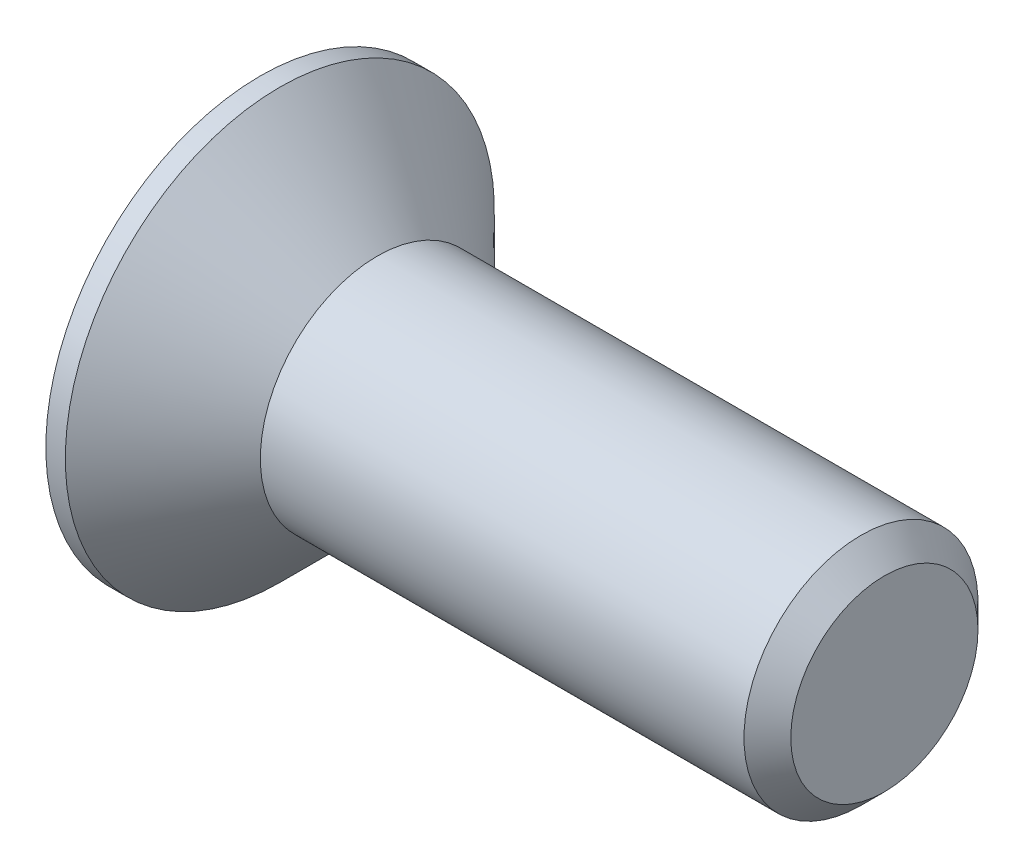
ISO-10303-21;
HEADER;
FILE_DESCRIPTION(('STEP AP214'),'2;1');
FILE_NAME('part.step','',(''),(''),'','','');
FILE_SCHEMA(('AUTOMOTIVE_DESIGN { 1 0 10303 214 1 1 1 1 }'));
ENDSEC;
DATA;
#1=APPLICATION_CONTEXT('core data for automotive mechanical design processes');
#2=APPLICATION_PROTOCOL_DEFINITION('international standard','automotive_design',2000,#1);
#3=PRODUCT_CONTEXT('',#1,'mechanical');
#4=PRODUCT('Part','Part','',(#3));
#5=PRODUCT_RELATED_PRODUCT_CATEGORY('part','',(#4));
#6=PRODUCT_DEFINITION_FORMATION('','',#4);
#7=PRODUCT_DEFINITION_CONTEXT('part definition',#1,'design');
#8=PRODUCT_DEFINITION('design','',#6,#7);
#9=PRODUCT_DEFINITION_SHAPE('','',#8);
#10=(LENGTH_UNIT() NAMED_UNIT(*) SI_UNIT(.MILLI.,.METRE.));
#11=(NAMED_UNIT(*) PLANE_ANGLE_UNIT() SI_UNIT($,.RADIAN.));
#12=(NAMED_UNIT(*) SI_UNIT($,.STERADIAN.) SOLID_ANGLE_UNIT());
#13=UNCERTAINTY_MEASURE_WITH_UNIT(LENGTH_MEASURE(1.E-05),#10,'distance_accuracy_value','');
#14=(GEOMETRIC_REPRESENTATION_CONTEXT(3) GLOBAL_UNCERTAINTY_ASSIGNED_CONTEXT((#13)) GLOBAL_UNIT_ASSIGNED_CONTEXT((#10,
#11,#12)) REPRESENTATION_CONTEXT('',''));
#15=CARTESIAN_POINT('',(0.,0.,0.));
#16=DIRECTION('',(0.,0.,1.));
#17=DIRECTION('',(1.,0.,0.));
#18=AXIS2_PLACEMENT_3D('',#15,#16,#17);
#19=CARTESIAN_POINT('',(0.,0.,0.));
#20=DIRECTION('',(-1.,0.,0.));
#21=DIRECTION('',(0.,-1.,0.));
#22=AXIS2_PLACEMENT_3D('',#19,#20,#21);
#23=CONICAL_SURFACE('',#22,3.,0.78539816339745);
#24=CARTESIAN_POINT('',(-2.49999999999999,0.,0.));
#25=DIRECTION('',(-1.,0.,0.));
#26=DIRECTION('',(0.,-1.,0.));
#27=AXIS2_PLACEMENT_3D('',#24,#25,#26);
#28=CIRCLE('',#27,5.5);
#29=CARTESIAN_POINT('',(-2.49999999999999,-5.5,0.));
#30=VERTEX_POINT('',#29);
#31=EDGE_CURVE('E189',#30,#30,#28,.T.);
#32=ORIENTED_EDGE('',*,*,#31,.F.);
#33=EDGE_LOOP('',(#32));
#34=FACE_BOUND('',#33,.T.);
#35=CARTESIAN_POINT('',(0.,0.,0.));
#36=DIRECTION('',(-1.,0.,0.));
#37=DIRECTION('',(0.,-1.,0.));
#38=AXIS2_PLACEMENT_3D('',#35,#36,#37);
#39=CIRCLE('',#38,3.);
#40=CARTESIAN_POINT('',(0.,-3.,0.));
#41=VERTEX_POINT('',#40);
#42=EDGE_CURVE('E212',#41,#41,#39,.T.);
#43=ORIENTED_EDGE('',*,*,#42,.T.);
#44=EDGE_LOOP('',(#43));
#45=FACE_BOUND('',#44,.T.);
#46=ADVANCED_FACE('F33',(#34,#45),#23,.T.);
#47=CARTESIAN_POINT('',(-3.,0.,0.));
#48=DIRECTION('',(-1.,0.,0.));
#49=DIRECTION('',(0.,-1.,0.));
#50=AXIS2_PLACEMENT_3D('',#47,#48,#49);
#51=CYLINDRICAL_SURFACE('',#50,3.);
#52=CARTESIAN_POINT('',(12.4,0.,0.));
#53=DIRECTION('',(-1.,0.,0.));
#54=DIRECTION('',(0.,-1.,0.));
#55=AXIS2_PLACEMENT_3D('',#52,#53,#54);
#56=CIRCLE('',#55,3.);
#57=CARTESIAN_POINT('',(12.4,-3.,0.));
#58=VERTEX_POINT('',#57);
#59=EDGE_CURVE('E41',#58,#58,#56,.T.);
#60=ORIENTED_EDGE('',*,*,#59,.T.);
#61=EDGE_LOOP('',(#60));
#62=FACE_BOUND('',#61,.T.);
#63=ORIENTED_EDGE('',*,*,#42,.F.);
#64=EDGE_LOOP('',(#63));
#65=FACE_BOUND('',#64,.T.);
#66=ADVANCED_FACE('F217',(#62,#65),#51,.T.);
#67=CARTESIAN_POINT('',(13.,0.,0.));
#68=DIRECTION('',(-1.,0.,0.));
#69=DIRECTION('',(0.,-1.,0.));
#70=AXIS2_PLACEMENT_3D('',#67,#68,#69);
#71=PLANE('',#70);
#72=CARTESIAN_POINT('',(13.,0.,0.));
#73=DIRECTION('',(-1.,0.,0.));
#74=DIRECTION('',(0.,-1.,0.));
#75=AXIS2_PLACEMENT_3D('',#72,#73,#74);
#76=CIRCLE('',#75,2.39999999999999);
#77=CARTESIAN_POINT('',(13.,-2.39999999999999,0.));
#78=VERTEX_POINT('',#77);
#79=EDGE_CURVE('E11',#78,#78,#76,.F.);
#80=ORIENTED_EDGE('',*,*,#79,.T.);
#81=EDGE_LOOP('',(#80));
#82=FACE_BOUND('',#81,.T.);
#83=ADVANCED_FACE('F239',(#82),#71,.F.);
#84=CARTESIAN_POINT('',(-3.,5.5,0.));
#85=DIRECTION('',(1.,0.,0.));
#86=DIRECTION('',(0.,1.,0.));
#87=AXIS2_PLACEMENT_3D('',#84,#85,#86);
#88=PLANE('',#87);
#89=DIRECTION('',(0.,0.,-1.));
#90=VECTOR('',#89,1.);
#91=CARTESIAN_POINT('',(-3.,0.825,-3.3));
#92=LINE('',#91,#90);
#93=CARTESIAN_POINT('',(-3.,0.825,-0.825));
#94=VERTEX_POINT('',#93);
#95=CARTESIAN_POINT('',(-3.,0.825,-3.3));
#96=VERTEX_POINT('',#95);
#97=EDGE_CURVE('E158',#94,#96,#92,.T.);
#98=ORIENTED_EDGE('',*,*,#97,.F.);
#99=DIRECTION('',(0.,-1.,0.));
#100=VECTOR('',#99,1.);
#101=CARTESIAN_POINT('',(-3.,0.825,-0.825));
#102=LINE('',#101,#100);
#103=CARTESIAN_POINT('',(-3.,3.3,-0.825));
#104=VERTEX_POINT('',#103);
#105=EDGE_CURVE('E48',#104,#94,#102,.T.);
#106=ORIENTED_EDGE('',*,*,#105,.F.);
#107=DIRECTION('',(0.,0.,-1.));
#108=VECTOR('',#107,1.);
#109=CARTESIAN_POINT('',(-3.,3.3,-0.825));
#110=LINE('',#109,#108);
#111=CARTESIAN_POINT('',(-3.,3.3,0.825));
#112=VERTEX_POINT('',#111);
#113=EDGE_CURVE('E185',#112,#104,#110,.T.);
#114=ORIENTED_EDGE('',*,*,#113,.F.);
#115=DIRECTION('',(0.,1.,0.));
#116=VECTOR('',#115,1.);
#117=CARTESIAN_POINT('',(-3.,3.3,0.825));
#118=LINE('',#117,#116);
#119=CARTESIAN_POINT('',(-3.,0.825,0.825));
#120=VERTEX_POINT('',#119);
#121=EDGE_CURVE('E183',#120,#112,#118,.T.);
#122=ORIENTED_EDGE('',*,*,#121,.F.);
#123=DIRECTION('',(0.,0.,-1.));
#124=VECTOR('',#123,1.);
#125=CARTESIAN_POINT('',(-3.,0.825,0.825));
#126=LINE('',#125,#124);
#127=CARTESIAN_POINT('',(-3.,0.825,3.3));
#128=VERTEX_POINT('',#127);
#129=EDGE_CURVE('E132',#128,#120,#126,.T.);
#130=ORIENTED_EDGE('',*,*,#129,.F.);
#131=DIRECTION('',(0.,1.,0.));
#132=VECTOR('',#131,1.);
#133=CARTESIAN_POINT('',(-3.,0.825,3.3));
#134=LINE('',#133,#132);
#135=CARTESIAN_POINT('',(-3.,-0.825,3.3));
#136=VERTEX_POINT('',#135);
#137=EDGE_CURVE('E179',#136,#128,#134,.T.);
#138=ORIENTED_EDGE('',*,*,#137,.F.);
#139=DIRECTION('',(0.,0.,1.));
#140=VECTOR('',#139,1.);
#141=CARTESIAN_POINT('',(-3.,-0.825,3.3));
#142=LINE('',#141,#140);
#143=CARTESIAN_POINT('',(-3.,-0.825,0.825));
#144=VERTEX_POINT('',#143);
#145=EDGE_CURVE('E176',#144,#136,#142,.T.);
#146=ORIENTED_EDGE('',*,*,#145,.F.);
#147=DIRECTION('',(0.,1.,0.));
#148=VECTOR('',#147,1.);
#149=CARTESIAN_POINT('',(-3.,-0.825,0.825));
#150=LINE('',#149,#148);
#151=CARTESIAN_POINT('',(-3.,-3.3,0.825));
#152=VERTEX_POINT('',#151);
#153=EDGE_CURVE('E173',#152,#144,#150,.T.);
#154=ORIENTED_EDGE('',*,*,#153,.F.);
#155=DIRECTION('',(0.,0.,1.));
#156=VECTOR('',#155,1.);
#157=CARTESIAN_POINT('',(-3.,-3.3,0.825));
#158=LINE('',#157,#156);
#159=CARTESIAN_POINT('',(-3.,-3.3,-0.825));
#160=VERTEX_POINT('',#159);
#161=EDGE_CURVE('E170',#160,#152,#158,.T.);
#162=ORIENTED_EDGE('',*,*,#161,.F.);
#163=DIRECTION('',(0.,-1.,0.));
#164=VECTOR('',#163,1.);
#165=CARTESIAN_POINT('',(-3.,-3.3,-0.825));
#166=LINE('',#165,#164);
#167=CARTESIAN_POINT('',(-3.,-0.825,-0.825));
#168=VERTEX_POINT('',#167);
#169=EDGE_CURVE('E167',#168,#160,#166,.T.);
#170=ORIENTED_EDGE('',*,*,#169,.F.);
#171=DIRECTION('',(0.,0.,1.));
#172=VECTOR('',#171,1.);
#173=CARTESIAN_POINT('',(-3.,-0.825,-0.825));
#174=LINE('',#173,#172);
#175=CARTESIAN_POINT('',(-3.,-0.825,-3.3));
#176=VERTEX_POINT('',#175);
#177=EDGE_CURVE('E164',#176,#168,#174,.T.);
#178=ORIENTED_EDGE('',*,*,#177,.F.);
#179=DIRECTION('',(0.,-1.,0.));
#180=VECTOR('',#179,1.);
#181=CARTESIAN_POINT('',(-3.,-0.825,-3.3));
#182=LINE('',#181,#180);
#183=EDGE_CURVE('E161',#96,#176,#182,.T.);
#184=ORIENTED_EDGE('',*,*,#183,.F.);
#185=EDGE_LOOP('',(#98,#106,#114,#122,#130,#138,#146,#154,#162,#170,#178,#184));
#186=FACE_BOUND('',#185,.T.);
#187=CARTESIAN_POINT('',(-3.,0.,0.));
#188=DIRECTION('',(-1.,0.,0.));
#189=DIRECTION('',(0.,-1.,0.));
#190=AXIS2_PLACEMENT_3D('',#187,#188,#189);
#191=CIRCLE('',#190,5.5);
#192=CARTESIAN_POINT('',(-3.,-5.5,0.));
#193=VERTEX_POINT('',#192);
#194=EDGE_CURVE('E209',#193,#193,#191,.T.);
#195=ORIENTED_EDGE('',*,*,#194,.T.);
#196=EDGE_LOOP('',(#195));
#197=FACE_BOUND('',#196,.T.);
#198=ADVANCED_FACE('F230',(#186,#197),#88,.F.);
#199=CARTESIAN_POINT('',(-3.,0.,0.));
#200=DIRECTION('',(-1.,0.,0.));
#201=DIRECTION('',(0.,-1.,0.));
#202=AXIS2_PLACEMENT_3D('',#199,#200,#201);
#203=CYLINDRICAL_SURFACE('',#202,5.5);
#204=ORIENTED_EDGE('',*,*,#194,.F.);
#205=EDGE_LOOP('',(#204));
#206=FACE_BOUND('',#205,.T.);
#207=ORIENTED_EDGE('',*,*,#31,.T.);
#208=EDGE_LOOP('',(#207));
#209=FACE_BOUND('',#208,.T.);
#210=ADVANCED_FACE('F222',(#206,#209),#203,.T.);
#211=CARTESIAN_POINT('',(12.4,0.,0.));
#212=DIRECTION('',(-1.,0.,0.));
#213=DIRECTION('',(0.,-1.,0.));
#214=AXIS2_PLACEMENT_3D('',#211,#212,#213);
#215=CONICAL_SURFACE('',#214,3.,0.785398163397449);
#216=ORIENTED_EDGE('',*,*,#79,.F.);
#217=EDGE_LOOP('',(#216));
#218=FACE_BOUND('',#217,.T.);
#219=ORIENTED_EDGE('',*,*,#59,.F.);
#220=EDGE_LOOP('',(#219));
#221=FACE_BOUND('',#220,.T.);
#222=ADVANCED_FACE('F35',(#218,#221),#215,.T.);
#223=CARTESIAN_POINT('',(-0.5,0.825,-0.825));
#224=DIRECTION('',(0.,0.,-1.));
#225=DIRECTION('',(-1.,0.,0.));
#226=AXIS2_PLACEMENT_3D('',#223,#224,#225);
#227=PLANE('',#226);
#228=ORIENTED_EDGE('',*,*,#105,.T.);
#229=DIRECTION('',(-1.,0.,0.));
#230=VECTOR('',#229,1.);
#231=CARTESIAN_POINT('',(-0.5,0.825,-0.825));
#232=LINE('',#231,#230);
#233=CARTESIAN_POINT('',(-0.5,0.825,-0.825));
#234=VERTEX_POINT('',#233);
#235=EDGE_CURVE('E96',#234,#94,#232,.T.);
#236=ORIENTED_EDGE('',*,*,#235,.F.);
#237=DIRECTION('',(0.,-1.,0.));
#238=VECTOR('',#237,1.);
#239=CARTESIAN_POINT('',(-0.5,0.825,-0.825));
#240=LINE('',#239,#238);
#241=CARTESIAN_POINT('',(-0.5,3.3,-0.825));
#242=VERTEX_POINT('',#241);
#243=EDGE_CURVE('E187',#242,#234,#240,.T.);
#244=ORIENTED_EDGE('',*,*,#243,.F.);
#245=DIRECTION('',(-1.,0.,0.));
#246=VECTOR('',#245,1.);
#247=CARTESIAN_POINT('',(-0.5,3.3,-0.825));
#248=LINE('',#247,#246);
#249=EDGE_CURVE('E56',#242,#104,#248,.T.);
#250=ORIENTED_EDGE('',*,*,#249,.T.);
#251=EDGE_LOOP('',(#228,#236,#244,#250));
#252=FACE_BOUND('',#251,.T.);
#253=ADVANCED_FACE('F221',(#252),#227,.F.);
#254=CARTESIAN_POINT('',(-0.5,3.3,-0.825));
#255=DIRECTION('',(0.,1.,0.));
#256=DIRECTION('',(-1.,0.,0.));
#257=AXIS2_PLACEMENT_3D('',#254,#255,#256);
#258=PLANE('',#257);
#259=ORIENTED_EDGE('',*,*,#113,.T.);
#260=ORIENTED_EDGE('',*,*,#249,.F.);
#261=DIRECTION('',(0.,0.,-1.));
#262=VECTOR('',#261,1.);
#263=CARTESIAN_POINT('',(-0.5,3.3,-0.825));
#264=LINE('',#263,#262);
#265=CARTESIAN_POINT('',(-0.5,3.3,0.825));
#266=VERTEX_POINT('',#265);
#267=EDGE_CURVE('E144',#266,#242,#264,.T.);
#268=ORIENTED_EDGE('',*,*,#267,.F.);
#269=DIRECTION('',(-1.,0.,0.));
#270=VECTOR('',#269,1.);
#271=CARTESIAN_POINT('',(-0.5,3.3,0.825));
#272=LINE('',#271,#270);
#273=EDGE_CURVE('E136',#266,#112,#272,.T.);
#274=ORIENTED_EDGE('',*,*,#273,.T.);
#275=EDGE_LOOP('',(#259,#260,#268,#274));
#276=FACE_BOUND('',#275,.T.);
#277=ADVANCED_FACE('F228',(#276),#258,.F.);
#278=CARTESIAN_POINT('',(-0.5,3.3,0.825));
#279=DIRECTION('',(0.,0.,1.));
#280=DIRECTION('',(1.,0.,0.));
#281=AXIS2_PLACEMENT_3D('',#278,#279,#280);
#282=PLANE('',#281);
#283=ORIENTED_EDGE('',*,*,#121,.T.);
#284=ORIENTED_EDGE('',*,*,#273,.F.);
#285=DIRECTION('',(0.,1.,0.));
#286=VECTOR('',#285,1.);
#287=CARTESIAN_POINT('',(-0.5,3.3,0.825));
#288=LINE('',#287,#286);
#289=CARTESIAN_POINT('',(-0.5,0.825,0.825));
#290=VERTEX_POINT('',#289);
#291=EDGE_CURVE('E140',#290,#266,#288,.T.);
#292=ORIENTED_EDGE('',*,*,#291,.F.);
#293=DIRECTION('',(-1.,0.,0.));
#294=VECTOR('',#293,1.);
#295=CARTESIAN_POINT('',(-0.5,0.825,0.825));
#296=LINE('',#295,#294);
#297=EDGE_CURVE('E125',#290,#120,#296,.T.);
#298=ORIENTED_EDGE('',*,*,#297,.T.);
#299=EDGE_LOOP('',(#283,#284,#292,#298));
#300=FACE_BOUND('',#299,.T.);
#301=ADVANCED_FACE('F141',(#300),#282,.F.);
#302=CARTESIAN_POINT('',(-0.5,0.825,0.825));
#303=DIRECTION('',(0.,1.,0.));
#304=DIRECTION('',(-1.,0.,0.));
#305=AXIS2_PLACEMENT_3D('',#302,#303,#304);
#306=PLANE('',#305);
#307=ORIENTED_EDGE('',*,*,#129,.T.);
#308=ORIENTED_EDGE('',*,*,#297,.F.);
#309=DIRECTION('',(0.,0.,-1.));
#310=VECTOR('',#309,1.);
#311=CARTESIAN_POINT('',(-0.5,0.825,0.825));
#312=LINE('',#311,#310);
#313=CARTESIAN_POINT('',(-0.5,0.825,3.3));
#314=VERTEX_POINT('',#313);
#315=EDGE_CURVE('E129',#314,#290,#312,.T.);
#316=ORIENTED_EDGE('',*,*,#315,.F.);
#317=DIRECTION('',(-1.,0.,0.));
#318=VECTOR('',#317,1.);
#319=CARTESIAN_POINT('',(-0.5,0.825,3.3));
#320=LINE('',#319,#318);
#321=EDGE_CURVE('E137',#314,#128,#320,.T.);
#322=ORIENTED_EDGE('',*,*,#321,.T.);
#323=EDGE_LOOP('',(#307,#308,#316,#322));
#324=FACE_BOUND('',#323,.T.);
#325=ADVANCED_FACE('F127',(#324),#306,.F.);
#326=CARTESIAN_POINT('',(-0.5,0.825,3.3));
#327=DIRECTION('',(0.,0.,1.));
#328=DIRECTION('',(1.,0.,0.));
#329=AXIS2_PLACEMENT_3D('',#326,#327,#328);
#330=PLANE('',#329);
#331=ORIENTED_EDGE('',*,*,#137,.T.);
#332=ORIENTED_EDGE('',*,*,#321,.F.);
#333=DIRECTION('',(0.,1.,0.));
#334=VECTOR('',#333,1.);
#335=CARTESIAN_POINT('',(-0.5,0.825,3.3));
#336=LINE('',#335,#334);
#337=CARTESIAN_POINT('',(-0.5,-0.825,3.3));
#338=VERTEX_POINT('',#337);
#339=EDGE_CURVE('E150',#338,#314,#336,.T.);
#340=ORIENTED_EDGE('',*,*,#339,.F.);
#341=DIRECTION('',(-1.,0.,0.));
#342=VECTOR('',#341,1.);
#343=CARTESIAN_POINT('',(-0.5,-0.825,3.3));
#344=LINE('',#343,#342);
#345=EDGE_CURVE('E192',#338,#136,#344,.T.);
#346=ORIENTED_EDGE('',*,*,#345,.T.);
#347=EDGE_LOOP('',(#331,#332,#340,#346));
#348=FACE_BOUND('',#347,.T.);
#349=ADVANCED_FACE('F277',(#348),#330,.F.);
#350=CARTESIAN_POINT('',(-0.5,-0.825,3.3));
#351=DIRECTION('',(0.,-1.,0.));
#352=DIRECTION('',(1.,0.,0.));
#353=AXIS2_PLACEMENT_3D('',#350,#351,#352);
#354=PLANE('',#353);
#355=ORIENTED_EDGE('',*,*,#145,.T.);
#356=ORIENTED_EDGE('',*,*,#345,.F.);
#357=DIRECTION('',(0.,0.,1.));
#358=VECTOR('',#357,1.);
#359=CARTESIAN_POINT('',(-0.5,-0.825,3.3));
#360=LINE('',#359,#358);
#361=CARTESIAN_POINT('',(-0.5,-0.825,0.825));
#362=VERTEX_POINT('',#361);
#363=EDGE_CURVE('E152',#362,#338,#360,.T.);
#364=ORIENTED_EDGE('',*,*,#363,.F.);
#365=DIRECTION('',(-1.,0.,0.));
#366=VECTOR('',#365,1.);
#367=CARTESIAN_POINT('',(-0.5,-0.825,0.825));
#368=LINE('',#367,#366);
#369=EDGE_CURVE('E194',#362,#144,#368,.T.);
#370=ORIENTED_EDGE('',*,*,#369,.T.);
#371=EDGE_LOOP('',(#355,#356,#364,#370));
#372=FACE_BOUND('',#371,.T.);
#373=ADVANCED_FACE('F273',(#372),#354,.F.);
#374=CARTESIAN_POINT('',(-0.5,-0.825,0.825));
#375=DIRECTION('',(0.,0.,1.));
#376=DIRECTION('',(1.,0.,0.));
#377=AXIS2_PLACEMENT_3D('',#374,#375,#376);
#378=PLANE('',#377);
#379=ORIENTED_EDGE('',*,*,#153,.T.);
#380=ORIENTED_EDGE('',*,*,#369,.F.);
#381=DIRECTION('',(0.,1.,0.));
#382=VECTOR('',#381,1.);
#383=CARTESIAN_POINT('',(-0.5,-0.825,0.825));
#384=LINE('',#383,#382);
#385=CARTESIAN_POINT('',(-0.5,-3.3,0.825));
#386=VERTEX_POINT('',#385);
#387=EDGE_CURVE('E422',#386,#362,#384,.T.);
#388=ORIENTED_EDGE('',*,*,#387,.F.);
#389=DIRECTION('',(-1.,0.,0.));
#390=VECTOR('',#389,1.);
#391=CARTESIAN_POINT('',(-0.5,-3.3,0.825));
#392=LINE('',#391,#390);
#393=EDGE_CURVE('E196',#386,#152,#392,.T.);
#394=ORIENTED_EDGE('',*,*,#393,.T.);
#395=EDGE_LOOP('',(#379,#380,#388,#394));
#396=FACE_BOUND('',#395,.T.);
#397=ADVANCED_FACE('F269',(#396),#378,.F.);
#398=CARTESIAN_POINT('',(-0.5,-3.3,0.825));
#399=DIRECTION('',(0.,-1.,0.));
#400=DIRECTION('',(1.,0.,0.));
#401=AXIS2_PLACEMENT_3D('',#398,#399,#400);
#402=PLANE('',#401);
#403=ORIENTED_EDGE('',*,*,#161,.T.);
#404=ORIENTED_EDGE('',*,*,#393,.F.);
#405=DIRECTION('',(0.,0.,1.));
#406=VECTOR('',#405,1.);
#407=CARTESIAN_POINT('',(-0.5,-3.3,0.825));
#408=LINE('',#407,#406);
#409=CARTESIAN_POINT('',(-0.5,-3.3,-0.825));
#410=VERTEX_POINT('',#409);
#411=EDGE_CURVE('E419',#410,#386,#408,.T.);
#412=ORIENTED_EDGE('',*,*,#411,.F.);
#413=DIRECTION('',(-1.,0.,0.));
#414=VECTOR('',#413,1.);
#415=CARTESIAN_POINT('',(-0.5,-3.3,-0.825));
#416=LINE('',#415,#414);
#417=EDGE_CURVE('E198',#410,#160,#416,.T.);
#418=ORIENTED_EDGE('',*,*,#417,.T.);
#419=EDGE_LOOP('',(#403,#404,#412,#418));
#420=FACE_BOUND('',#419,.T.);
#421=ADVANCED_FACE('F265',(#420),#402,.F.);
#422=CARTESIAN_POINT('',(-0.5,-3.3,-0.825));
#423=DIRECTION('',(0.,0.,-1.));
#424=DIRECTION('',(-1.,0.,0.));
#425=AXIS2_PLACEMENT_3D('',#422,#423,#424);
#426=PLANE('',#425);
#427=ORIENTED_EDGE('',*,*,#169,.T.);
#428=ORIENTED_EDGE('',*,*,#417,.F.);
#429=DIRECTION('',(0.,-1.,0.));
#430=VECTOR('',#429,1.);
#431=CARTESIAN_POINT('',(-0.5,-3.3,-0.825));
#432=LINE('',#431,#430);
#433=CARTESIAN_POINT('',(-0.5,-0.825,-0.825));
#434=VERTEX_POINT('',#433);
#435=EDGE_CURVE('E416',#434,#410,#432,.T.);
#436=ORIENTED_EDGE('',*,*,#435,.F.);
#437=DIRECTION('',(-1.,0.,0.));
#438=VECTOR('',#437,1.);
#439=CARTESIAN_POINT('',(-0.5,-0.825,-0.825));
#440=LINE('',#439,#438);
#441=EDGE_CURVE('E200',#434,#168,#440,.T.);
#442=ORIENTED_EDGE('',*,*,#441,.T.);
#443=EDGE_LOOP('',(#427,#428,#436,#442));
#444=FACE_BOUND('',#443,.T.);
#445=ADVANCED_FACE('F261',(#444),#426,.F.);
#446=CARTESIAN_POINT('',(-0.5,-0.825,-0.825));
#447=DIRECTION('',(0.,-1.,0.));
#448=DIRECTION('',(1.,0.,0.));
#449=AXIS2_PLACEMENT_3D('',#446,#447,#448);
#450=PLANE('',#449);
#451=ORIENTED_EDGE('',*,*,#177,.T.);
#452=ORIENTED_EDGE('',*,*,#441,.F.);
#453=DIRECTION('',(0.,0.,1.));
#454=VECTOR('',#453,1.);
#455=CARTESIAN_POINT('',(-0.5,-0.825,-0.825));
#456=LINE('',#455,#454);
#457=CARTESIAN_POINT('',(-0.5,-0.825,-3.3));
#458=VERTEX_POINT('',#457);
#459=EDGE_CURVE('E413',#458,#434,#456,.T.);
#460=ORIENTED_EDGE('',*,*,#459,.F.);
#461=DIRECTION('',(-1.,0.,0.));
#462=VECTOR('',#461,1.);
#463=CARTESIAN_POINT('',(-0.5,-0.825,-3.3));
#464=LINE('',#463,#462);
#465=EDGE_CURVE('E202',#458,#176,#464,.T.);
#466=ORIENTED_EDGE('',*,*,#465,.T.);
#467=EDGE_LOOP('',(#451,#452,#460,#466));
#468=FACE_BOUND('',#467,.T.);
#469=ADVANCED_FACE('F257',(#468),#450,.F.);
#470=CARTESIAN_POINT('',(-0.5,-0.825,-3.3));
#471=DIRECTION('',(0.,0.,-1.));
#472=DIRECTION('',(-1.,0.,0.));
#473=AXIS2_PLACEMENT_3D('',#470,#471,#472);
#474=PLANE('',#473);
#475=ORIENTED_EDGE('',*,*,#183,.T.);
#476=ORIENTED_EDGE('',*,*,#465,.F.);
#477=DIRECTION('',(0.,-1.,0.));
#478=VECTOR('',#477,1.);
#479=CARTESIAN_POINT('',(-0.5,-0.825,-3.3));
#480=LINE('',#479,#478);
#481=CARTESIAN_POINT('',(-0.5,0.825,-3.3));
#482=VERTEX_POINT('',#481);
#483=EDGE_CURVE('E408',#482,#458,#480,.T.);
#484=ORIENTED_EDGE('',*,*,#483,.F.);
#485=DIRECTION('',(-1.,0.,0.));
#486=VECTOR('',#485,1.);
#487=CARTESIAN_POINT('',(-0.5,0.825,-3.3));
#488=LINE('',#487,#486);
#489=EDGE_CURVE('E204',#482,#96,#488,.T.);
#490=ORIENTED_EDGE('',*,*,#489,.T.);
#491=EDGE_LOOP('',(#475,#476,#484,#490));
#492=FACE_BOUND('',#491,.T.);
#493=ADVANCED_FACE('F253',(#492),#474,.F.);
#494=CARTESIAN_POINT('',(-0.5,0.825,-3.3));
#495=DIRECTION('',(0.,1.,0.));
#496=DIRECTION('',(-1.,0.,0.));
#497=AXIS2_PLACEMENT_3D('',#494,#495,#496);
#498=PLANE('',#497);
#499=ORIENTED_EDGE('',*,*,#97,.T.);
#500=ORIENTED_EDGE('',*,*,#489,.F.);
#501=DIRECTION('',(0.,0.,-1.));
#502=VECTOR('',#501,1.);
#503=CARTESIAN_POINT('',(-0.5,0.825,-3.3));
#504=LINE('',#503,#502);
#505=EDGE_CURVE('E406',#234,#482,#504,.T.);
#506=ORIENTED_EDGE('',*,*,#505,.F.);
#507=ORIENTED_EDGE('',*,*,#235,.T.);
#508=EDGE_LOOP('',(#499,#500,#506,#507));
#509=FACE_BOUND('',#508,.T.);
#510=ADVANCED_FACE('F250',(#509),#498,.F.);
#511=CARTESIAN_POINT('',(-0.5,0.,0.));
#512=DIRECTION('',(1.,0.,0.));
#513=DIRECTION('',(0.,0.,-1.));
#514=AXIS2_PLACEMENT_3D('',#511,#512,#513);
#515=PLANE('',#514);
#516=ORIENTED_EDGE('',*,*,#243,.T.);
#517=ORIENTED_EDGE('',*,*,#505,.T.);
#518=ORIENTED_EDGE('',*,*,#483,.T.);
#519=ORIENTED_EDGE('',*,*,#459,.T.);
#520=ORIENTED_EDGE('',*,*,#435,.T.);
#521=ORIENTED_EDGE('',*,*,#411,.T.);
#522=ORIENTED_EDGE('',*,*,#387,.T.);
#523=ORIENTED_EDGE('',*,*,#363,.T.);
#524=ORIENTED_EDGE('',*,*,#339,.T.);
#525=ORIENTED_EDGE('',*,*,#315,.T.);
#526=ORIENTED_EDGE('',*,*,#291,.T.);
#527=ORIENTED_EDGE('',*,*,#267,.T.);
#528=EDGE_LOOP('',(#516,#517,#518,#519,#520,#521,#522,#523,#524,#525,#526,#527));
#529=FACE_BOUND('',#528,.T.);
#530=ADVANCED_FACE('F147',(#529),#515,.F.);
#531=CLOSED_SHELL('',(#46,#66,#83,#198,#210,#222,#253,#277,#301,#325,#349,#373,#397,#421,#445,
#469,#493,#510,#530));
#532=MANIFOLD_SOLID_BREP('B2',#531);
#533=ADVANCED_BREP_SHAPE_REPRESENTATION('',(#18,#532),#14);
#534=SHAPE_DEFINITION_REPRESENTATION(#9,#533);
ENDSEC;
END-ISO-10303-21;
